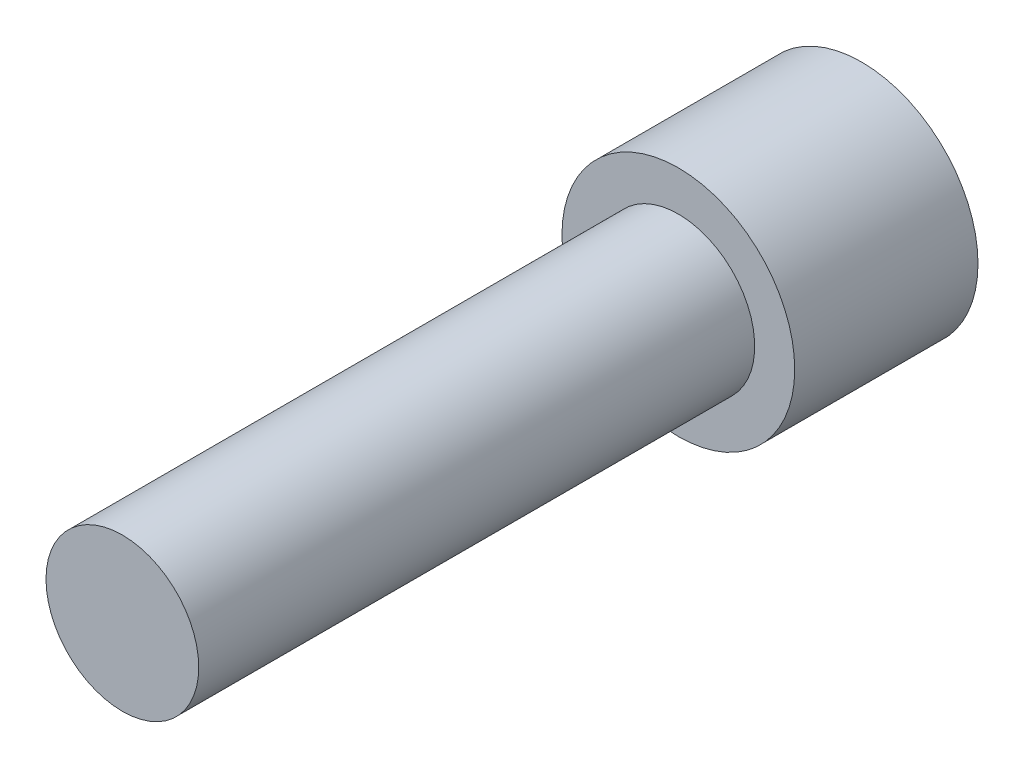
ISO-10303-21;
HEADER;
FILE_DESCRIPTION(('STEP AP214'),'2;1');
FILE_NAME('part.step','',(''),(''),'','','');
FILE_SCHEMA(('AUTOMOTIVE_DESIGN { 1 0 10303 214 1 1 1 1 }'));
ENDSEC;
DATA;
#1=APPLICATION_CONTEXT('core data for automotive mechanical design processes');
#2=APPLICATION_PROTOCOL_DEFINITION('international standard','automotive_design',2000,#1);
#3=PRODUCT_CONTEXT('',#1,'mechanical');
#4=PRODUCT('Part','Part','',(#3));
#5=PRODUCT_RELATED_PRODUCT_CATEGORY('part','',(#4));
#6=PRODUCT_DEFINITION_FORMATION('','',#4);
#7=PRODUCT_DEFINITION_CONTEXT('part definition',#1,'design');
#8=PRODUCT_DEFINITION('design','',#6,#7);
#9=PRODUCT_DEFINITION_SHAPE('','',#8);
#10=(LENGTH_UNIT() NAMED_UNIT(*) SI_UNIT(.MILLI.,.METRE.));
#11=(NAMED_UNIT(*) PLANE_ANGLE_UNIT() SI_UNIT($,.RADIAN.));
#12=(NAMED_UNIT(*) SI_UNIT($,.STERADIAN.) SOLID_ANGLE_UNIT());
#13=UNCERTAINTY_MEASURE_WITH_UNIT(LENGTH_MEASURE(1.E-05),#10,'distance_accuracy_value','');
#14=(GEOMETRIC_REPRESENTATION_CONTEXT(3) GLOBAL_UNCERTAINTY_ASSIGNED_CONTEXT((#13)) GLOBAL_UNIT_ASSIGNED_CONTEXT((#10,
#11,#12)) REPRESENTATION_CONTEXT('',''));
#15=CARTESIAN_POINT('',(0.,0.,0.));
#16=DIRECTION('',(0.,0.,1.));
#17=DIRECTION('',(1.,0.,0.));
#18=AXIS2_PLACEMENT_3D('',#15,#16,#17);
#19=CARTESIAN_POINT('',(0.,0.,91.));
#20=DIRECTION('',(0.,0.,-1.));
#21=DIRECTION('',(-1.,0.,0.));
#22=AXIS2_PLACEMENT_3D('',#19,#20,#21);
#23=CYLINDRICAL_SURFACE('',#22,12.5);
#24=CARTESIAN_POINT('',(0.,0.,91.));
#25=DIRECTION('',(0.,0.,1.));
#26=DIRECTION('',(1.,0.,0.));
#27=AXIS2_PLACEMENT_3D('',#24,#25,#26);
#28=CIRCLE('',#27,12.5);
#29=CARTESIAN_POINT('',(12.5,0.,91.));
#30=VERTEX_POINT('',#29);
#31=EDGE_CURVE('E10',#30,#30,#28,.T.);
#32=ORIENTED_EDGE('',*,*,#31,.F.);
#33=EDGE_LOOP('',(#32));
#34=FACE_BOUND('',#33,.T.);
#35=CARTESIAN_POINT('',(0.,0.,0.));
#36=DIRECTION('',(0.,0.,-1.));
#37=DIRECTION('',(-1.,0.,0.));
#38=AXIS2_PLACEMENT_3D('',#35,#36,#37);
#39=CIRCLE('',#38,12.5);
#40=CARTESIAN_POINT('',(-12.5,0.,0.));
#41=VERTEX_POINT('',#40);
#42=EDGE_CURVE('E31',#41,#41,#39,.T.);
#43=ORIENTED_EDGE('',*,*,#42,.F.);
#44=EDGE_LOOP('',(#43));
#45=FACE_BOUND('',#44,.T.);
#46=ADVANCED_FACE('F25',(#34,#45),#23,.T.);
#47=CARTESIAN_POINT('',(0.,0.,91.));
#48=DIRECTION('',(0.,0.,1.));
#49=DIRECTION('',(1.,0.,0.));
#50=AXIS2_PLACEMENT_3D('',#47,#48,#49);
#51=PLANE('',#50);
#52=ORIENTED_EDGE('',*,*,#31,.T.);
#53=EDGE_LOOP('',(#52));
#54=FACE_BOUND('',#53,.T.);
#55=ADVANCED_FACE('F84',(#54),#51,.T.);
#56=CARTESIAN_POINT('',(0.,0.,0.));
#57=DIRECTION('',(0.,0.,-1.));
#58=DIRECTION('',(-1.,0.,0.));
#59=AXIS2_PLACEMENT_3D('',#56,#57,#58);
#60=PLANE('',#59);
#61=CARTESIAN_POINT('',(0.,0.,0.));
#62=DIRECTION('',(0.,0.,-1.));
#63=DIRECTION('',(-1.,0.,0.));
#64=AXIS2_PLACEMENT_3D('',#61,#62,#63);
#65=CIRCLE('',#64,19.05);
#66=CARTESIAN_POINT('',(-19.05,0.,0.));
#67=VERTEX_POINT('',#66);
#68=EDGE_CURVE('E39',#67,#67,#65,.T.);
#69=ORIENTED_EDGE('',*,*,#68,.F.);
#70=EDGE_LOOP('',(#69));
#71=FACE_BOUND('',#70,.T.);
#72=ORIENTED_EDGE('',*,*,#42,.T.);
#73=EDGE_LOOP('',(#72));
#74=FACE_BOUND('',#73,.T.);
#75=ADVANCED_FACE('F79',(#71,#74),#60,.F.);
#76=CARTESIAN_POINT('',(0.,0.,-30.));
#77=DIRECTION('',(0.,0.,1.));
#78=DIRECTION('',(1.,0.,0.));
#79=AXIS2_PLACEMENT_3D('',#76,#77,#78);
#80=CYLINDRICAL_SURFACE('',#79,19.05);
#81=CARTESIAN_POINT('',(0.,0.,-30.));
#82=DIRECTION('',(0.,0.,-1.));
#83=DIRECTION('',(-1.,0.,0.));
#84=AXIS2_PLACEMENT_3D('',#81,#82,#83);
#85=CIRCLE('',#84,19.05);
#86=CARTESIAN_POINT('',(-19.05,0.,-30.));
#87=VERTEX_POINT('',#86);
#88=EDGE_CURVE('E35',#87,#87,#85,.T.);
#89=ORIENTED_EDGE('',*,*,#88,.F.);
#90=EDGE_LOOP('',(#89));
#91=FACE_BOUND('',#90,.T.);
#92=ORIENTED_EDGE('',*,*,#68,.T.);
#93=EDGE_LOOP('',(#92));
#94=FACE_BOUND('',#93,.T.);
#95=ADVANCED_FACE('F69',(#91,#94),#80,.T.);
#96=CARTESIAN_POINT('',(0.,0.,-30.));
#97=DIRECTION('',(0.,0.,-1.));
#98=DIRECTION('',(-1.,0.,0.));
#99=AXIS2_PLACEMENT_3D('',#96,#97,#98);
#100=PLANE('',#99);
#101=CARTESIAN_POINT('',(12.525,0.,-30.));
#102=DIRECTION('',(0.,0.,-1.));
#103=DIRECTION('',(1.,0.,0.));
#104=AXIS2_PLACEMENT_3D('',#101,#102,#103);
#105=CIRCLE('',#104,2.375);
#106=CARTESIAN_POINT('',(14.9,0.,-30.));
#107=VERTEX_POINT('',#106);
#108=EDGE_CURVE('E59',#107,#107,#105,.T.);
#109=ORIENTED_EDGE('',*,*,#108,.F.);
#110=EDGE_LOOP('',(#109));
#111=FACE_BOUND('',#110,.T.);
#112=CARTESIAN_POINT('',(-12.525,0.,-30.));
#113=DIRECTION('',(0.,0.,-1.));
#114=DIRECTION('',(-1.,0.,0.));
#115=AXIS2_PLACEMENT_3D('',#112,#113,#114);
#116=CIRCLE('',#115,2.375);
#117=CARTESIAN_POINT('',(-14.9,0.,-30.));
#118=VERTEX_POINT('',#117);
#119=EDGE_CURVE('E53',#118,#118,#116,.T.);
#120=ORIENTED_EDGE('',*,*,#119,.F.);
#121=EDGE_LOOP('',(#120));
#122=FACE_BOUND('',#121,.T.);
#123=CARTESIAN_POINT('',(0.,0.,-30.));
#124=DIRECTION('',(0.,0.,-1.));
#125=DIRECTION('',(-1.,0.,0.));
#126=AXIS2_PLACEMENT_3D('',#123,#124,#125);
#127=CIRCLE('',#126,6.);
#128=CARTESIAN_POINT('',(-6.,0.,-30.));
#129=VERTEX_POINT('',#128);
#130=EDGE_CURVE('E47',#129,#129,#127,.T.);
#131=ORIENTED_EDGE('',*,*,#130,.F.);
#132=EDGE_LOOP('',(#131));
#133=FACE_BOUND('',#132,.T.);
#134=ORIENTED_EDGE('',*,*,#88,.T.);
#135=EDGE_LOOP('',(#134));
#136=FACE_BOUND('',#135,.T.);
#137=ADVANCED_FACE('F65',(#111,#122,#133,#136),#100,.T.);
#138=CARTESIAN_POINT('',(0.,0.,-10.));
#139=DIRECTION('',(0.,0.,-1.));
#140=DIRECTION('',(-1.,0.,0.));
#141=AXIS2_PLACEMENT_3D('',#138,#139,#140);
#142=CYLINDRICAL_SURFACE('',#141,6.);
#143=CARTESIAN_POINT('',(0.,0.,-10.));
#144=DIRECTION('',(0.,0.,-1.));
#145=DIRECTION('',(-1.,0.,0.));
#146=AXIS2_PLACEMENT_3D('',#143,#144,#145);
#147=CIRCLE('',#146,6.);
#148=CARTESIAN_POINT('',(-6.,0.,-10.));
#149=VERTEX_POINT('',#148);
#150=EDGE_CURVE('E44',#149,#149,#147,.T.);
#151=ORIENTED_EDGE('',*,*,#150,.F.);
#152=EDGE_LOOP('',(#151));
#153=FACE_BOUND('',#152,.T.);
#154=ORIENTED_EDGE('',*,*,#130,.T.);
#155=EDGE_LOOP('',(#154));
#156=FACE_BOUND('',#155,.T.);
#157=ADVANCED_FACE('F68',(#153,#156),#142,.F.);
#158=CARTESIAN_POINT('',(0.,0.,-10.));
#159=DIRECTION('',(0.,0.,-1.));
#160=DIRECTION('',(-1.,0.,0.));
#161=AXIS2_PLACEMENT_3D('',#158,#159,#160);
#162=PLANE('',#161);
#163=ORIENTED_EDGE('',*,*,#150,.T.);
#164=EDGE_LOOP('',(#163));
#165=FACE_BOUND('',#164,.T.);
#166=ADVANCED_FACE('F118',(#165),#162,.T.);
#167=CARTESIAN_POINT('',(-12.525,0.,-15.));
#168=DIRECTION('',(0.,0.,-1.));
#169=DIRECTION('',(-1.,0.,0.));
#170=AXIS2_PLACEMENT_3D('',#167,#168,#169);
#171=CYLINDRICAL_SURFACE('',#170,2.375);
#172=CARTESIAN_POINT('',(-12.525,0.,-15.));
#173=DIRECTION('',(0.,0.,-1.));
#174=DIRECTION('',(-1.,0.,0.));
#175=AXIS2_PLACEMENT_3D('',#172,#173,#174);
#176=CIRCLE('',#175,2.375);
#177=CARTESIAN_POINT('',(-14.9,0.,-15.));
#178=VERTEX_POINT('',#177);
#179=EDGE_CURVE('E50',#178,#178,#176,.T.);
#180=ORIENTED_EDGE('',*,*,#179,.F.);
#181=EDGE_LOOP('',(#180));
#182=FACE_BOUND('',#181,.T.);
#183=ORIENTED_EDGE('',*,*,#119,.T.);
#184=EDGE_LOOP('',(#183));
#185=FACE_BOUND('',#184,.T.);
#186=ADVANCED_FACE('F124',(#182,#185),#171,.F.);
#187=CARTESIAN_POINT('',(-12.525,0.,-15.));
#188=DIRECTION('',(0.,0.,-1.));
#189=DIRECTION('',(-1.,0.,0.));
#190=AXIS2_PLACEMENT_3D('',#187,#188,#189);
#191=PLANE('',#190);
#192=ORIENTED_EDGE('',*,*,#179,.T.);
#193=EDGE_LOOP('',(#192));
#194=FACE_BOUND('',#193,.T.);
#195=ADVANCED_FACE('F131',(#194),#191,.T.);
#196=CARTESIAN_POINT('',(12.525,0.,-15.));
#197=DIRECTION('',(0.,0.,-1.));
#198=DIRECTION('',(-1.,0.,0.));
#199=AXIS2_PLACEMENT_3D('',#196,#197,#198);
#200=CYLINDRICAL_SURFACE('',#199,2.375);
#201=CARTESIAN_POINT('',(12.525,0.,-15.));
#202=DIRECTION('',(0.,0.,-1.));
#203=DIRECTION('',(1.,0.,0.));
#204=AXIS2_PLACEMENT_3D('',#201,#202,#203);
#205=CIRCLE('',#204,2.375);
#206=CARTESIAN_POINT('',(14.9,0.,-15.));
#207=VERTEX_POINT('',#206);
#208=EDGE_CURVE('E56',#207,#207,#205,.T.);
#209=ORIENTED_EDGE('',*,*,#208,.F.);
#210=EDGE_LOOP('',(#209));
#211=FACE_BOUND('',#210,.T.);
#212=ORIENTED_EDGE('',*,*,#108,.T.);
#213=EDGE_LOOP('',(#212));
#214=FACE_BOUND('',#213,.T.);
#215=ADVANCED_FACE('F63',(#211,#214),#200,.F.);
#216=CARTESIAN_POINT('',(12.525,0.,-15.));
#217=DIRECTION('',(0.,0.,1.));
#218=DIRECTION('',(1.,0.,0.));
#219=AXIS2_PLACEMENT_3D('',#216,#217,#218);
#220=PLANE('',#219);
#221=ORIENTED_EDGE('',*,*,#208,.T.);
#222=EDGE_LOOP('',(#221));
#223=FACE_BOUND('',#222,.T.);
#224=ADVANCED_FACE('F146',(#223),#220,.F.);
#225=CLOSED_SHELL('',(#46,#55,#75,#95,#137,#157,#166,#186,#195,#215,#224));
#226=MANIFOLD_SOLID_BREP('B2',#225);
#227=ADVANCED_BREP_SHAPE_REPRESENTATION('',(#18,#226),#14);
#228=SHAPE_DEFINITION_REPRESENTATION(#9,#227);
ENDSEC;
END-ISO-10303-21;
